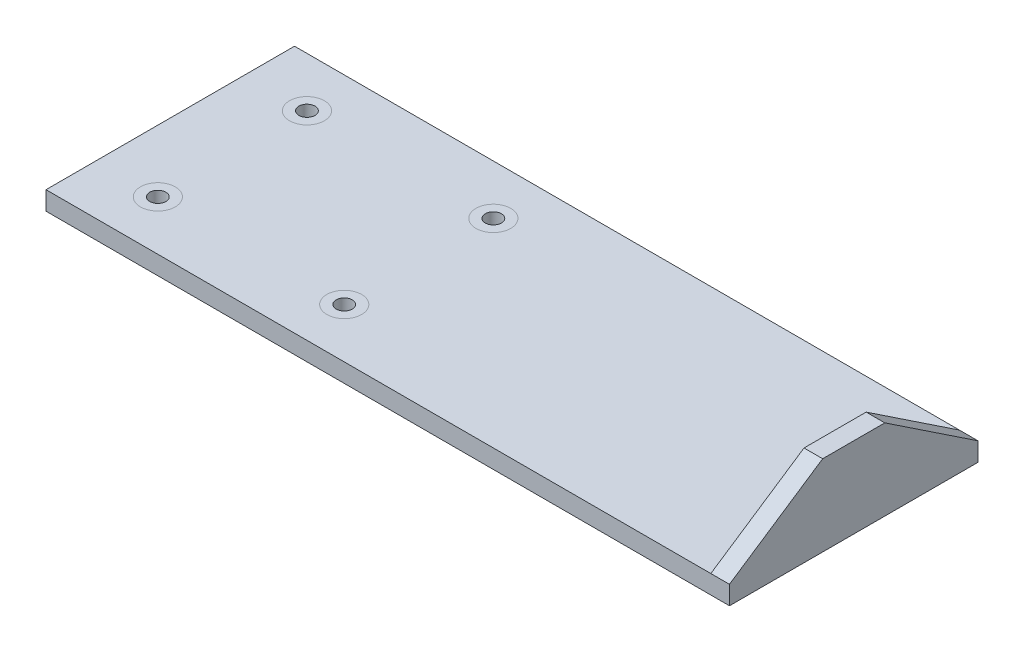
ISO-10303-21;
HEADER;
FILE_DESCRIPTION(('STEP AP214'),'2;1');
FILE_NAME('part.step','',(''),(''),'','','');
FILE_SCHEMA(('AUTOMOTIVE_DESIGN { 1 0 10303 214 1 1 1 1 }'));
ENDSEC;
DATA;
#1=APPLICATION_CONTEXT('core data for automotive mechanical design processes');
#2=APPLICATION_PROTOCOL_DEFINITION('international standard','automotive_design',2000,#1);
#3=PRODUCT_CONTEXT('',#1,'mechanical');
#4=PRODUCT('Part','Part','',(#3));
#5=PRODUCT_RELATED_PRODUCT_CATEGORY('part','',(#4));
#6=PRODUCT_DEFINITION_FORMATION('','',#4);
#7=PRODUCT_DEFINITION_CONTEXT('part definition',#1,'design');
#8=PRODUCT_DEFINITION('design','',#6,#7);
#9=PRODUCT_DEFINITION_SHAPE('','',#8);
#10=(LENGTH_UNIT() NAMED_UNIT(*) SI_UNIT(.MILLI.,.METRE.));
#11=(NAMED_UNIT(*) PLANE_ANGLE_UNIT() SI_UNIT($,.RADIAN.));
#12=(NAMED_UNIT(*) SI_UNIT($,.STERADIAN.) SOLID_ANGLE_UNIT());
#13=UNCERTAINTY_MEASURE_WITH_UNIT(LENGTH_MEASURE(1.E-05),#10,'distance_accuracy_value','');
#14=(GEOMETRIC_REPRESENTATION_CONTEXT(3) GLOBAL_UNCERTAINTY_ASSIGNED_CONTEXT((#13)) GLOBAL_UNIT_ASSIGNED_CONTEXT((#10,
#11,#12)) REPRESENTATION_CONTEXT('',''));
#15=CARTESIAN_POINT('',(0.,0.,0.));
#16=DIRECTION('',(0.,0.,1.));
#17=DIRECTION('',(1.,0.,0.));
#18=AXIS2_PLACEMENT_3D('',#15,#16,#17);
#19=CARTESIAN_POINT('',(0.,0.,-100.));
#20=DIRECTION('',(0.,1.,0.));
#21=DIRECTION('',(0.,0.,1.));
#22=AXIS2_PLACEMENT_3D('',#19,#20,#21);
#23=PLANE('',#22);
#24=CARTESIAN_POINT('',(50.,0.,60.));
#25=DIRECTION('',(0.,1.,0.));
#26=DIRECTION('',(0.,0.,1.));
#27=AXIS2_PLACEMENT_3D('',#24,#25,#26);
#28=CIRCLE('',#27,14.);
#29=CARTESIAN_POINT('',(50.,0.,74.));
#30=VERTEX_POINT('',#29);
#31=EDGE_CURVE('E43',#30,#30,#28,.F.);
#32=ORIENTED_EDGE('',*,*,#31,.T.);
#33=EDGE_LOOP('',(#32));
#34=FACE_BOUND('',#33,.T.);
#35=CARTESIAN_POINT('',(50.,0.,-60.));
#36=DIRECTION('',(0.,1.,0.));
#37=DIRECTION('',(0.,0.,1.));
#38=AXIS2_PLACEMENT_3D('',#35,#36,#37);
#39=CIRCLE('',#38,14.);
#40=CARTESIAN_POINT('',(50.,0.,-46.));
#41=VERTEX_POINT('',#40);
#42=EDGE_CURVE('E165',#41,#41,#39,.F.);
#43=ORIENTED_EDGE('',*,*,#42,.T.);
#44=EDGE_LOOP('',(#43));
#45=FACE_BOUND('',#44,.T.);
#46=DIRECTION('',(0.,0.,1.));
#47=VECTOR('',#46,1.);
#48=CARTESIAN_POINT('',(535.,0.,-100.));
#49=LINE('',#48,#47);
#50=CARTESIAN_POINT('',(535.,0.,-100.));
#51=VERTEX_POINT('',#50);
#52=CARTESIAN_POINT('',(535.,0.,100.));
#53=VERTEX_POINT('',#52);
#54=EDGE_CURVE('E149',#51,#53,#49,.T.);
#55=ORIENTED_EDGE('',*,*,#54,.F.);
#56=DIRECTION('',(-1.,0.,0.));
#57=VECTOR('',#56,1.);
#58=CARTESIAN_POINT('',(0.,0.,-100.));
#59=LINE('',#58,#57);
#60=CARTESIAN_POINT('',(0.,0.,-100.));
#61=VERTEX_POINT('',#60);
#62=EDGE_CURVE('E157',#51,#61,#59,.T.);
#63=ORIENTED_EDGE('',*,*,#62,.T.);
#64=DIRECTION('',(0.,0.,1.));
#65=VECTOR('',#64,1.);
#66=CARTESIAN_POINT('',(0.,0.,-100.));
#67=LINE('',#66,#65);
#68=CARTESIAN_POINT('',(0.,0.,100.));
#69=VERTEX_POINT('',#68);
#70=EDGE_CURVE('E291',#61,#69,#67,.T.);
#71=ORIENTED_EDGE('',*,*,#70,.T.);
#72=DIRECTION('',(1.,0.,0.));
#73=VECTOR('',#72,1.);
#74=CARTESIAN_POINT('',(0.,0.,100.));
#75=LINE('',#74,#73);
#76=EDGE_CURVE('E275',#69,#53,#75,.T.);
#77=ORIENTED_EDGE('',*,*,#76,.T.);
#78=EDGE_LOOP('',(#55,#63,#71,#77));
#79=FACE_BOUND('',#78,.T.);
#80=CARTESIAN_POINT('',(200.,0.,-60.));
#81=DIRECTION('',(0.,1.,0.));
#82=DIRECTION('',(0.,0.,1.));
#83=AXIS2_PLACEMENT_3D('',#80,#81,#82);
#84=CIRCLE('',#83,14.);
#85=CARTESIAN_POINT('',(200.,0.,-46.));
#86=VERTEX_POINT('',#85);
#87=EDGE_CURVE('E169',#86,#86,#84,.F.);
#88=ORIENTED_EDGE('',*,*,#87,.T.);
#89=EDGE_LOOP('',(#88));
#90=FACE_BOUND('',#89,.T.);
#91=CARTESIAN_POINT('',(200.,0.,60.));
#92=DIRECTION('',(0.,1.,0.));
#93=DIRECTION('',(0.,0.,1.));
#94=AXIS2_PLACEMENT_3D('',#91,#92,#93);
#95=CIRCLE('',#94,14.);
#96=CARTESIAN_POINT('',(200.,0.,74.));
#97=VERTEX_POINT('',#96);
#98=EDGE_CURVE('E12',#97,#97,#95,.F.);
#99=ORIENTED_EDGE('',*,*,#98,.T.);
#100=EDGE_LOOP('',(#99));
#101=FACE_BOUND('',#100,.T.);
#102=ADVANCED_FACE('F34',(#34,#45,#79,#90,#101),#23,.T.);
#103=ORIENTED_EDGE('',*,*,#98,.F.);
#104=EDGE_LOOP('',(#103));
#105=FACE_BOUND('',#104,.T.);
#106=CARTESIAN_POINT('',(200.,0.,60.));
#107=DIRECTION('',(0.,1.,0.));
#108=DIRECTION('',(0.,0.,1.));
#109=AXIS2_PLACEMENT_3D('',#106,#107,#108);
#110=CIRCLE('',#109,6.50000000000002);
#111=CARTESIAN_POINT('',(200.,0.,66.5));
#112=VERTEX_POINT('',#111);
#113=EDGE_CURVE('E197',#112,#112,#110,.T.);
#114=ORIENTED_EDGE('',*,*,#113,.F.);
#115=EDGE_LOOP('',(#114));
#116=FACE_BOUND('',#115,.T.);
#117=ADVANCED_FACE('F184',(#105,#116),#23,.T.);
#118=ORIENTED_EDGE('',*,*,#31,.F.);
#119=EDGE_LOOP('',(#118));
#120=FACE_BOUND('',#119,.T.);
#121=CARTESIAN_POINT('',(50.,0.,60.));
#122=DIRECTION('',(0.,1.,0.));
#123=DIRECTION('',(0.,0.,1.));
#124=AXIS2_PLACEMENT_3D('',#121,#122,#123);
#125=CIRCLE('',#124,6.5);
#126=CARTESIAN_POINT('',(50.,0.,66.5));
#127=VERTEX_POINT('',#126);
#128=EDGE_CURVE('E188',#127,#127,#125,.T.);
#129=ORIENTED_EDGE('',*,*,#128,.F.);
#130=EDGE_LOOP('',(#129));
#131=FACE_BOUND('',#130,.T.);
#132=ADVANCED_FACE('F180',(#120,#131),#23,.T.);
#133=ORIENTED_EDGE('',*,*,#87,.F.);
#134=EDGE_LOOP('',(#133));
#135=FACE_BOUND('',#134,.T.);
#136=CARTESIAN_POINT('',(200.,0.,-60.));
#137=DIRECTION('',(0.,1.,0.));
#138=DIRECTION('',(0.,0.,1.));
#139=AXIS2_PLACEMENT_3D('',#136,#137,#138);
#140=CIRCLE('',#139,6.50000000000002);
#141=CARTESIAN_POINT('',(200.,0.,-53.5));
#142=VERTEX_POINT('',#141);
#143=EDGE_CURVE('E194',#142,#142,#140,.T.);
#144=ORIENTED_EDGE('',*,*,#143,.F.);
#145=EDGE_LOOP('',(#144));
#146=FACE_BOUND('',#145,.T.);
#147=ADVANCED_FACE('F183',(#135,#146),#23,.T.);
#148=CARTESIAN_POINT('',(0.,-15.,-100.));
#149=DIRECTION('',(0.,1.,0.));
#150=DIRECTION('',(0.,0.,1.));
#151=AXIS2_PLACEMENT_3D('',#148,#149,#150);
#152=PLANE('',#151);
#153=CARTESIAN_POINT('',(200.,-15.,60.));
#154=DIRECTION('',(0.,1.,0.));
#155=DIRECTION('',(0.,0.,1.));
#156=AXIS2_PLACEMENT_3D('',#153,#154,#155);
#157=CIRCLE('',#156,6.50000000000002);
#158=CARTESIAN_POINT('',(200.,-15.,66.5));
#159=VERTEX_POINT('',#158);
#160=EDGE_CURVE('E191',#159,#159,#157,.T.);
#161=ORIENTED_EDGE('',*,*,#160,.T.);
#162=EDGE_LOOP('',(#161));
#163=FACE_BOUND('',#162,.T.);
#164=CARTESIAN_POINT('',(50.,-15.,60.));
#165=DIRECTION('',(0.,1.,0.));
#166=DIRECTION('',(0.,0.,1.));
#167=AXIS2_PLACEMENT_3D('',#164,#165,#166);
#168=CIRCLE('',#167,6.5);
#169=CARTESIAN_POINT('',(50.,-15.,66.5));
#170=VERTEX_POINT('',#169);
#171=EDGE_CURVE('E190',#170,#170,#168,.T.);
#172=ORIENTED_EDGE('',*,*,#171,.T.);
#173=EDGE_LOOP('',(#172));
#174=FACE_BOUND('',#173,.T.);
#175=CARTESIAN_POINT('',(200.,-15.,-60.));
#176=DIRECTION('',(0.,1.,0.));
#177=DIRECTION('',(0.,0.,1.));
#178=AXIS2_PLACEMENT_3D('',#175,#176,#177);
#179=CIRCLE('',#178,6.50000000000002);
#180=CARTESIAN_POINT('',(200.,-15.,-53.5));
#181=VERTEX_POINT('',#180);
#182=EDGE_CURVE('E203',#181,#181,#179,.T.);
#183=ORIENTED_EDGE('',*,*,#182,.T.);
#184=EDGE_LOOP('',(#183));
#185=FACE_BOUND('',#184,.T.);
#186=CARTESIAN_POINT('',(50.,-15.,-60.));
#187=DIRECTION('',(0.,1.,0.));
#188=DIRECTION('',(0.,0.,1.));
#189=AXIS2_PLACEMENT_3D('',#186,#187,#188);
#190=CIRCLE('',#189,6.5);
#191=CARTESIAN_POINT('',(50.,-15.,-53.5));
#192=VERTEX_POINT('',#191);
#193=EDGE_CURVE('E127',#192,#192,#190,.T.);
#194=ORIENTED_EDGE('',*,*,#193,.T.);
#195=EDGE_LOOP('',(#194));
#196=FACE_BOUND('',#195,.T.);
#197=DIRECTION('',(-1.,0.,0.));
#198=VECTOR('',#197,1.);
#199=CARTESIAN_POINT('',(0.,-15.,-100.));
#200=LINE('',#199,#198);
#201=CARTESIAN_POINT('',(250.,-15.,-100.));
#202=VERTEX_POINT('',#201);
#203=CARTESIAN_POINT('',(0.,-15.,-100.));
#204=VERTEX_POINT('',#203);
#205=EDGE_CURVE('E300',#202,#204,#200,.T.);
#206=ORIENTED_EDGE('',*,*,#205,.F.);
#207=DIRECTION('',(0.,0.,1.));
#208=VECTOR('',#207,1.);
#209=CARTESIAN_POINT('',(250.,-15.,-100.));
#210=LINE('',#209,#208);
#211=CARTESIAN_POINT('',(250.,-15.,100.));
#212=VERTEX_POINT('',#211);
#213=EDGE_CURVE('E50',#202,#212,#210,.T.);
#214=ORIENTED_EDGE('',*,*,#213,.T.);
#215=DIRECTION('',(1.,0.,0.));
#216=VECTOR('',#215,1.);
#217=CARTESIAN_POINT('',(0.,-15.,100.));
#218=LINE('',#217,#216);
#219=CARTESIAN_POINT('',(0.,-15.,100.));
#220=VERTEX_POINT('',#219);
#221=EDGE_CURVE('E298',#220,#212,#218,.T.);
#222=ORIENTED_EDGE('',*,*,#221,.F.);
#223=DIRECTION('',(0.,0.,1.));
#224=VECTOR('',#223,1.);
#225=CARTESIAN_POINT('',(0.,-15.,-100.));
#226=LINE('',#225,#224);
#227=EDGE_CURVE('E281',#204,#220,#226,.T.);
#228=ORIENTED_EDGE('',*,*,#227,.F.);
#229=EDGE_LOOP('',(#206,#214,#222,#228));
#230=FACE_BOUND('',#229,.T.);
#231=ADVANCED_FACE('F223',(#163,#174,#185,#196,#230),#152,.F.);
#232=CARTESIAN_POINT('',(0.,-15.,-100.));
#233=DIRECTION('',(0.,0.,-1.));
#234=DIRECTION('',(-1.,0.,0.));
#235=AXIS2_PLACEMENT_3D('',#232,#233,#234);
#236=PLANE('',#235);
#237=ORIENTED_EDGE('',*,*,#62,.F.);
#238=DIRECTION('',(1.,0.,0.));
#239=VECTOR('',#238,1.);
#240=CARTESIAN_POINT('',(-869.792066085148,0.,-100.));
#241=LINE('',#240,#239);
#242=CARTESIAN_POINT('',(550.,0.,-100.));
#243=VERTEX_POINT('',#242);
#244=EDGE_CURVE('E121',#51,#243,#241,.T.);
#245=ORIENTED_EDGE('',*,*,#244,.T.);
#246=DIRECTION('',(0.,1.,0.));
#247=VECTOR('',#246,1.);
#248=CARTESIAN_POINT('',(550.,-15.,-100.));
#249=LINE('',#248,#247);
#250=CARTESIAN_POINT('',(550.,-15.,-100.));
#251=VERTEX_POINT('',#250);
#252=EDGE_CURVE('E110',#251,#243,#249,.T.);
#253=ORIENTED_EDGE('',*,*,#252,.F.);
#254=EDGE_CURVE('E289',#251,#202,#200,.T.);
#255=ORIENTED_EDGE('',*,*,#254,.T.);
#256=ORIENTED_EDGE('',*,*,#205,.T.);
#257=DIRECTION('',(0.,1.,0.));
#258=VECTOR('',#257,1.);
#259=CARTESIAN_POINT('',(0.,-15.,-100.));
#260=LINE('',#259,#258);
#261=EDGE_CURVE('E163',#204,#61,#260,.T.);
#262=ORIENTED_EDGE('',*,*,#261,.T.);
#263=EDGE_LOOP('',(#237,#245,#253,#255,#256,#262));
#264=FACE_BOUND('',#263,.T.);
#265=ADVANCED_FACE('F232',(#264),#236,.T.);
#266=CARTESIAN_POINT('',(550.,-15.,-100.));
#267=DIRECTION('',(1.,0.,0.));
#268=DIRECTION('',(0.,0.,-1.));
#269=AXIS2_PLACEMENT_3D('',#266,#267,#268);
#270=PLANE('',#269);
#271=DIRECTION('',(0.,0.554700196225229,-0.832050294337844));
#272=VECTOR('',#271,1.);
#273=CARTESIAN_POINT('',(550.,87.6923076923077,-31.5384615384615));
#274=LINE('',#273,#272);
#275=CARTESIAN_POINT('',(550.,0.,100.));
#276=VERTEX_POINT('',#275);
#277=CARTESIAN_POINT('',(550.,50.,25.));
#278=VERTEX_POINT('',#277);
#279=EDGE_CURVE('E115',#276,#278,#274,.T.);
#280=ORIENTED_EDGE('',*,*,#279,.F.);
#281=DIRECTION('',(0.,1.,0.));
#282=VECTOR('',#281,1.);
#283=CARTESIAN_POINT('',(550.,-15.,100.));
#284=LINE('',#283,#282);
#285=CARTESIAN_POINT('',(550.,-15.,100.));
#286=VERTEX_POINT('',#285);
#287=EDGE_CURVE('E98',#286,#276,#284,.T.);
#288=ORIENTED_EDGE('',*,*,#287,.F.);
#289=DIRECTION('',(0.,0.,-1.));
#290=VECTOR('',#289,1.);
#291=CARTESIAN_POINT('',(550.,-15.,-100.));
#292=LINE('',#291,#290);
#293=EDGE_CURVE('E283',#286,#251,#292,.T.);
#294=ORIENTED_EDGE('',*,*,#293,.T.);
#295=ORIENTED_EDGE('',*,*,#252,.T.);
#296=DIRECTION('',(0.,0.554700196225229,0.832050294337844));
#297=VECTOR('',#296,1.);
#298=CARTESIAN_POINT('',(550.,-4.61538461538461,-106.923076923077));
#299=LINE('',#298,#297);
#300=CARTESIAN_POINT('',(550.,50.,-25.));
#301=VERTEX_POINT('',#300);
#302=EDGE_CURVE('E145',#243,#301,#299,.T.);
#303=ORIENTED_EDGE('',*,*,#302,.T.);
#304=DIRECTION('',(0.,0.,-1.));
#305=VECTOR('',#304,1.);
#306=CARTESIAN_POINT('',(550.,50.,-100.));
#307=LINE('',#306,#305);
#308=EDGE_CURVE('E118',#278,#301,#307,.T.);
#309=ORIENTED_EDGE('',*,*,#308,.F.);
#310=EDGE_LOOP('',(#280,#288,#294,#295,#303,#309));
#311=FACE_BOUND('',#310,.T.);
#312=ADVANCED_FACE('F116',(#311),#270,.T.);
#313=CARTESIAN_POINT('',(535.,50.,-100.));
#314=DIRECTION('',(1.,0.,0.));
#315=DIRECTION('',(0.,0.,-1.));
#316=AXIS2_PLACEMENT_3D('',#313,#314,#315);
#317=PLANE('',#316);
#318=ORIENTED_EDGE('',*,*,#54,.T.);
#319=DIRECTION('',(0.,0.554700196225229,-0.832050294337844));
#320=VECTOR('',#319,1.);
#321=CARTESIAN_POINT('',(535.,107.692307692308,-61.5384615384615));
#322=LINE('',#321,#320);
#323=CARTESIAN_POINT('',(535.,50.,25.));
#324=VERTEX_POINT('',#323);
#325=EDGE_CURVE('E122',#53,#324,#322,.T.);
#326=ORIENTED_EDGE('',*,*,#325,.T.);
#327=DIRECTION('',(0.,0.,1.));
#328=VECTOR('',#327,1.);
#329=CARTESIAN_POINT('',(535.,50.,-100.));
#330=LINE('',#329,#328);
#331=CARTESIAN_POINT('',(535.,50.,-25.));
#332=VERTEX_POINT('',#331);
#333=EDGE_CURVE('E303',#332,#324,#330,.T.);
#334=ORIENTED_EDGE('',*,*,#333,.F.);
#335=DIRECTION('',(0.,0.554700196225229,0.832050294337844));
#336=VECTOR('',#335,1.);
#337=CARTESIAN_POINT('',(535.,15.3846153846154,-76.9230769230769));
#338=LINE('',#337,#336);
#339=EDGE_CURVE('E142',#51,#332,#338,.T.);
#340=ORIENTED_EDGE('',*,*,#339,.F.);
#341=EDGE_LOOP('',(#318,#326,#334,#340));
#342=FACE_BOUND('',#341,.T.);
#343=ADVANCED_FACE('F259',(#342),#317,.F.);
#344=CARTESIAN_POINT('',(550.,50.,-100.));
#345=DIRECTION('',(0.,-1.,0.));
#346=DIRECTION('',(0.,0.,-1.));
#347=AXIS2_PLACEMENT_3D('',#344,#345,#346);
#348=PLANE('',#347);
#349=ORIENTED_EDGE('',*,*,#333,.T.);
#350=DIRECTION('',(1.,0.,0.));
#351=VECTOR('',#350,1.);
#352=CARTESIAN_POINT('',(-219.792095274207,50.,25.));
#353=LINE('',#352,#351);
#354=EDGE_CURVE('E126',#324,#278,#353,.T.);
#355=ORIENTED_EDGE('',*,*,#354,.T.);
#356=ORIENTED_EDGE('',*,*,#308,.T.);
#357=DIRECTION('',(1.,0.,0.));
#358=VECTOR('',#357,1.);
#359=CARTESIAN_POINT('',(550.,50.,-25.));
#360=LINE('',#359,#358);
#361=EDGE_CURVE('E160',#332,#301,#360,.T.);
#362=ORIENTED_EDGE('',*,*,#361,.F.);
#363=EDGE_LOOP('',(#349,#355,#356,#362));
#364=FACE_BOUND('',#363,.T.);
#365=ADVANCED_FACE('F257',(#364),#348,.F.);
#366=CARTESIAN_POINT('',(0.,-15.,-100.));
#367=DIRECTION('',(-1.,0.,0.));
#368=DIRECTION('',(0.,0.,1.));
#369=AXIS2_PLACEMENT_3D('',#366,#367,#368);
#370=PLANE('',#369);
#371=ORIENTED_EDGE('',*,*,#70,.F.);
#372=ORIENTED_EDGE('',*,*,#261,.F.);
#373=ORIENTED_EDGE('',*,*,#227,.T.);
#374=DIRECTION('',(0.,1.,0.));
#375=VECTOR('',#374,1.);
#376=CARTESIAN_POINT('',(0.,-15.,100.));
#377=LINE('',#376,#375);
#378=EDGE_CURVE('E111',#220,#69,#377,.T.);
#379=ORIENTED_EDGE('',*,*,#378,.T.);
#380=EDGE_LOOP('',(#371,#372,#373,#379));
#381=FACE_BOUND('',#380,.T.);
#382=ADVANCED_FACE('F36',(#381),#370,.T.);
#383=CARTESIAN_POINT('',(0.,-15.,100.));
#384=DIRECTION('',(0.,0.,1.));
#385=DIRECTION('',(1.,0.,0.));
#386=AXIS2_PLACEMENT_3D('',#383,#384,#385);
#387=PLANE('',#386);
#388=DIRECTION('',(1.,0.,0.));
#389=VECTOR('',#388,1.);
#390=CARTESIAN_POINT('',(-219.792095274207,0.,100.));
#391=LINE('',#390,#389);
#392=EDGE_CURVE('E103',#53,#276,#391,.T.);
#393=ORIENTED_EDGE('',*,*,#392,.F.);
#394=ORIENTED_EDGE('',*,*,#76,.F.);
#395=ORIENTED_EDGE('',*,*,#378,.F.);
#396=ORIENTED_EDGE('',*,*,#221,.T.);
#397=EDGE_CURVE('E106',#212,#286,#218,.T.);
#398=ORIENTED_EDGE('',*,*,#397,.T.);
#399=ORIENTED_EDGE('',*,*,#287,.T.);
#400=EDGE_LOOP('',(#393,#394,#395,#396,#398,#399));
#401=FACE_BOUND('',#400,.T.);
#402=ADVANCED_FACE('F100',(#401),#387,.T.);
#403=ORIENTED_EDGE('',*,*,#213,.F.);
#404=ORIENTED_EDGE('',*,*,#254,.F.);
#405=ORIENTED_EDGE('',*,*,#293,.F.);
#406=ORIENTED_EDGE('',*,*,#397,.F.);
#407=EDGE_LOOP('',(#403,#404,#405,#406));
#408=FACE_BOUND('',#407,.T.);
#409=ADVANCED_FACE('F214',(#408),#152,.F.);
#410=ORIENTED_EDGE('',*,*,#42,.F.);
#411=EDGE_LOOP('',(#410));
#412=FACE_BOUND('',#411,.T.);
#413=CARTESIAN_POINT('',(50.,0.,-60.));
#414=DIRECTION('',(0.,1.,0.));
#415=DIRECTION('',(0.,0.,1.));
#416=AXIS2_PLACEMENT_3D('',#413,#414,#415);
#417=CIRCLE('',#416,6.5);
#418=CARTESIAN_POINT('',(50.,0.,-53.5));
#419=VERTEX_POINT('',#418);
#420=EDGE_CURVE('E131',#419,#419,#417,.T.);
#421=ORIENTED_EDGE('',*,*,#420,.F.);
#422=EDGE_LOOP('',(#421));
#423=FACE_BOUND('',#422,.T.);
#424=ADVANCED_FACE('F211',(#412,#423),#23,.T.);
#425=CARTESIAN_POINT('',(-869.792066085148,0.,-100.));
#426=DIRECTION('',(0.,0.832050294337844,-0.554700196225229));
#427=DIRECTION('',(0.,0.554700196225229,0.832050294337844));
#428=AXIS2_PLACEMENT_3D('',#425,#426,#427);
#429=PLANE('',#428);
#430=ORIENTED_EDGE('',*,*,#302,.F.);
#431=ORIENTED_EDGE('',*,*,#244,.F.);
#432=ORIENTED_EDGE('',*,*,#339,.T.);
#433=ORIENTED_EDGE('',*,*,#361,.T.);
#434=EDGE_LOOP('',(#430,#431,#432,#433));
#435=FACE_BOUND('',#434,.T.);
#436=ADVANCED_FACE('F213',(#435),#429,.T.);
#437=CARTESIAN_POINT('',(-219.792095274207,0.,100.));
#438=DIRECTION('',(0.,-0.832050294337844,-0.554700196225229));
#439=DIRECTION('',(0.,0.554700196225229,-0.832050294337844));
#440=AXIS2_PLACEMENT_3D('',#437,#438,#439);
#441=PLANE('',#440);
#442=ORIENTED_EDGE('',*,*,#392,.T.);
#443=ORIENTED_EDGE('',*,*,#279,.T.);
#444=ORIENTED_EDGE('',*,*,#354,.F.);
#445=ORIENTED_EDGE('',*,*,#325,.F.);
#446=EDGE_LOOP('',(#442,#443,#444,#445));
#447=FACE_BOUND('',#446,.T.);
#448=ADVANCED_FACE('F125',(#447),#441,.F.);
#449=CARTESIAN_POINT('',(50.,-15.,-60.));
#450=DIRECTION('',(0.,1.,0.));
#451=DIRECTION('',(0.,0.,1.));
#452=AXIS2_PLACEMENT_3D('',#449,#450,#451);
#453=CYLINDRICAL_SURFACE('',#452,6.5);
#454=ORIENTED_EDGE('',*,*,#193,.F.);
#455=EDGE_LOOP('',(#454));
#456=FACE_BOUND('',#455,.T.);
#457=ORIENTED_EDGE('',*,*,#420,.T.);
#458=EDGE_LOOP('',(#457));
#459=FACE_BOUND('',#458,.T.);
#460=ADVANCED_FACE('F209',(#456,#459),#453,.F.);
#461=CARTESIAN_POINT('',(200.,-15.,-60.));
#462=DIRECTION('',(0.,1.,0.));
#463=DIRECTION('',(0.,0.,1.));
#464=AXIS2_PLACEMENT_3D('',#461,#462,#463);
#465=CYLINDRICAL_SURFACE('',#464,6.50000000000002);
#466=ORIENTED_EDGE('',*,*,#182,.F.);
#467=EDGE_LOOP('',(#466));
#468=FACE_BOUND('',#467,.T.);
#469=ORIENTED_EDGE('',*,*,#143,.T.);
#470=EDGE_LOOP('',(#469));
#471=FACE_BOUND('',#470,.T.);
#472=ADVANCED_FACE('F238',(#468,#471),#465,.F.);
#473=CARTESIAN_POINT('',(50.,-15.,60.));
#474=DIRECTION('',(0.,1.,0.));
#475=DIRECTION('',(0.,0.,1.));
#476=AXIS2_PLACEMENT_3D('',#473,#474,#475);
#477=CYLINDRICAL_SURFACE('',#476,6.5);
#478=ORIENTED_EDGE('',*,*,#171,.F.);
#479=EDGE_LOOP('',(#478));
#480=FACE_BOUND('',#479,.T.);
#481=ORIENTED_EDGE('',*,*,#128,.T.);
#482=EDGE_LOOP('',(#481));
#483=FACE_BOUND('',#482,.T.);
#484=ADVANCED_FACE('F240',(#480,#483),#477,.F.);
#485=CARTESIAN_POINT('',(200.,-15.,60.));
#486=DIRECTION('',(0.,1.,0.));
#487=DIRECTION('',(0.,0.,1.));
#488=AXIS2_PLACEMENT_3D('',#485,#486,#487);
#489=CYLINDRICAL_SURFACE('',#488,6.50000000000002);
#490=ORIENTED_EDGE('',*,*,#160,.F.);
#491=EDGE_LOOP('',(#490));
#492=FACE_BOUND('',#491,.T.);
#493=ORIENTED_EDGE('',*,*,#113,.T.);
#494=EDGE_LOOP('',(#493));
#495=FACE_BOUND('',#494,.T.);
#496=ADVANCED_FACE('F247',(#492,#495),#489,.F.);
#497=CLOSED_SHELL('',(#102,#117,#132,#147,#231,#265,#312,#343,#365,#382,#402,#409,#424,#436,
#448,#460,#472,#484,#496));
#498=MANIFOLD_SOLID_BREP('B2',#497);
#499=ADVANCED_BREP_SHAPE_REPRESENTATION('',(#18,#498),#14);
#500=SHAPE_DEFINITION_REPRESENTATION(#9,#499);
ENDSEC;
END-ISO-10303-21;
